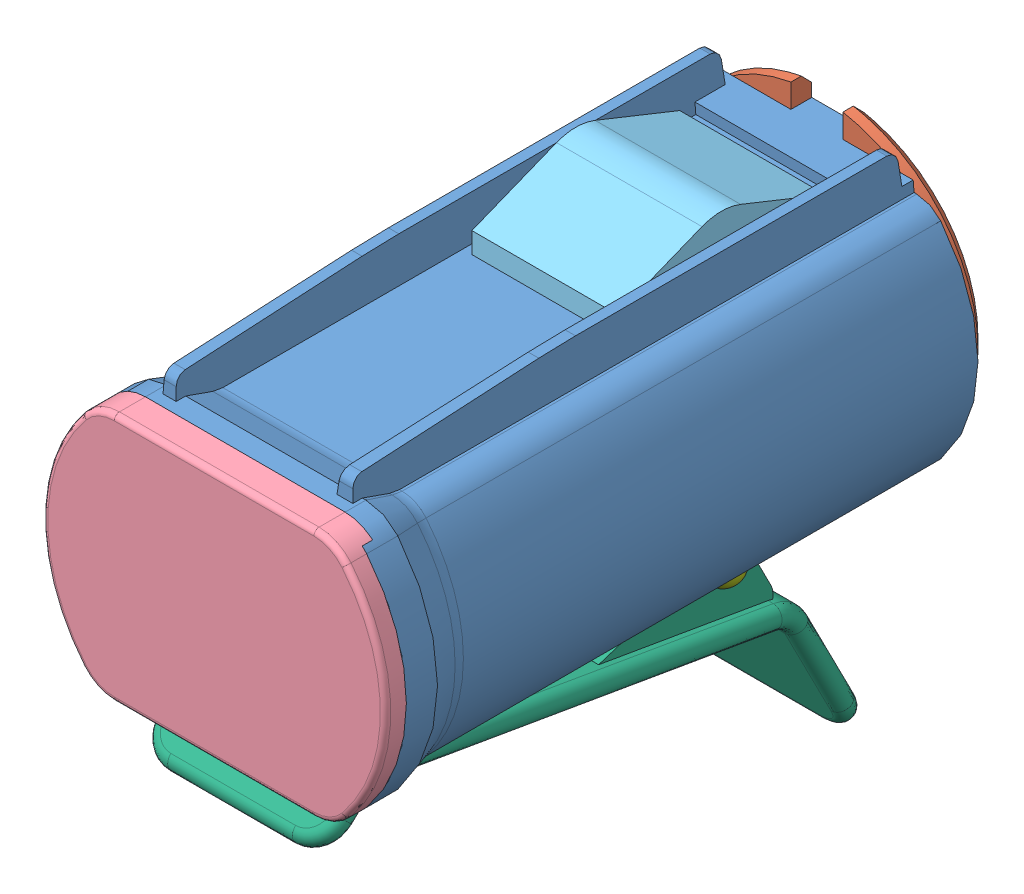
SolidWorks assembly Base_&.sldasm, configuration Default (file format 15000). Lengths in mm.
Overall size (33.32 48.63 64).
8 component instances, 7 part files, 17 mates.
Components (placement in the parent):
- Holder_&-1: Holder_&.SLDPRT [Default] at origin size (33 31 58)
- Round Swivel Cap_&-1: Round Swivel Cap_&.SLDPRT [Default] x (1 0 0) z (0 0 -1) size (29 28.78 15)
- Battery AA_&-1: Battery AA_&.SLDPRT [Default] at (7.3344 0.888 6.6952) x (0 0 1) z (-0.996552 0.08297 0) size (49.71 14.22 14.22)
- Battery AA_&-2: Battery AA_&.SLDPRT [Default] at (-7.3344 0.888 5.6209) x (0 0 1) z (-0.43163 0.902051 0) size (49.71 14.22 14.22)
- Battery Cover_&-1: Battery Cover_&.SLDPRT [Default] at (0 0 55) size (33 24 3)
- Switch_&-2: Switch_&.SLDPRT [Default] at (0.2461 11 16.4441) x (0 0 1) z (-1 0 0) size (20 7.5 15.5)
- Clip_&-2: Clip_&.SLDPRT [Default] at (0 -16.5763 31.2585) x (0 -0.169656 -0.985503) z (1 0 0) size (54.4 18.6 18)
- Pin_&-1: Pin_&.SLDPRT [Default] at (7.5 -13.1148 16) x (0 0.408678 0.912679) z (-1 0 0) size (3.28 3.28 17.17)
Mates (geometry in assembly coordinates):
- Coincident1: coincident anti-aligned: plane of Holder-1 through (0 0 0) normal (0 0 -1); plane of Round Swivel Cap-1 through (0 0 0) normal (0 0 1)
- Coincident4: coincident anti-aligned: line of Holder-1 through (0 0 56) axis (0 0 -1); line of Round Swivel Cap-1 through (0 0 0) axis (0 0 1)
- Parallel1: parallel aligned: plane of Holder-1 through (-10.5 -11 53) normal (0 -1 0); plane of Round Swivel Cap-1 through (11.3688 -9 2) normal (0 -1 0)
- Tangent1: tangent aligned: cylinder of Holder-1 through (0 0 53) axis (0 0 -1) radius 14.5; cylinder of Battery AA-1 through (7.3344 0.888 6.6952) axis (0 0 -1) radius 7.112
- Tangent2: tangent anti-aligned: plane of Holder-1 through (7.9961 8 -2.2361) normal (0 -1 0); cylinder of Battery AA-1 through (7.3344 0.888 6.6952) axis (0 0 -1) radius 7.112
- Tangent3: tangent aligned: cylinder of Holder-1 through (0 0 53) axis (0 0 -1) radius 14.5; cylinder of Battery AA-2 through (-7.3344 0.888 5.6209) axis (0 0 -1) radius 7.112
- Tangent4: tangent anti-aligned: plane of Holder-1 through (-7.9961 8 -2.2361) normal (0 -1 0); cylinder of Battery AA-2 through (-7.3344 0.888 5.6209) axis (0 0 -1) radius 7.112
- Coincident25: coincident anti-aligned: plane of Holder-1 through (-10.0623 -9 55) normal (0 0 1); plane of Battery Cover-1 through (-9.6047 -8 55) normal (0 0 -1)
- Coincident26: coincident aligned: plane of Holder-1 through (0 0 0) normal (0 1 0); plane of Battery Cover-1 through (0 0 55) normal (0 1 0)
- Coincident27: coincident aligned: plane of Holder-1 through (0 0 0) normal (1 0 0); plane of Battery Cover-1 through (0 0 55) normal (1 0 0)
- Coincident28: coincident anti-aligned: plane of Holder-1 through (7.2461 -15.1774 6) normal (-1 0 0); plane of Switch-2 through (7.2461 11 26.4441) normal (1 0 0)
- Coincident29: coincident anti-aligned: plane of Holder-1 through (-10.5 11 53) normal (0 1 0); plane of Switch-2 through (-6.7539 11 6.4441) normal (0 -1 0)
- Concentric6: concentric aligned: cylinder of Holder-1 through (16.5 -13.1148 16) axis (-1 0 0) radius 1; cylinder of Clip-2 through (-6.5 -13.1148 16) axis (-1 0 0) radius 1
- Distance2: distance = 1 mm anti-aligned: plane of Holder-1 through (-5.5 -13.1148 16) normal (-1 0 0); plane of Clip-2 through (-6.5 -21.7708 12.8732) normal (1 0 0)
- Tangent5: tangent anti-aligned: plane of Holder-1 through (0 -12 53) normal (0 -0.948683 -0.316228); cylinder of Clip-2 through (9 -15.3238 50.3223) axis (-1 0 0) radius 4
- Concentric7: concentric aligned: cylinder of Clip-2 through (6.5 -13.1148 16) axis (1 0 0) radius 1; cylinder of Pin-1 through (-8.5 -13.1148 16) axis (1 0 0) radius 0.75
- Coincident30: coincident anti-aligned: plane of Clip-2 through (7.5 -21.7708 12.8732) normal (1 0 0); plane of Pin-1 through (7.5 -13.1148 16) normal (-1 0 0)
